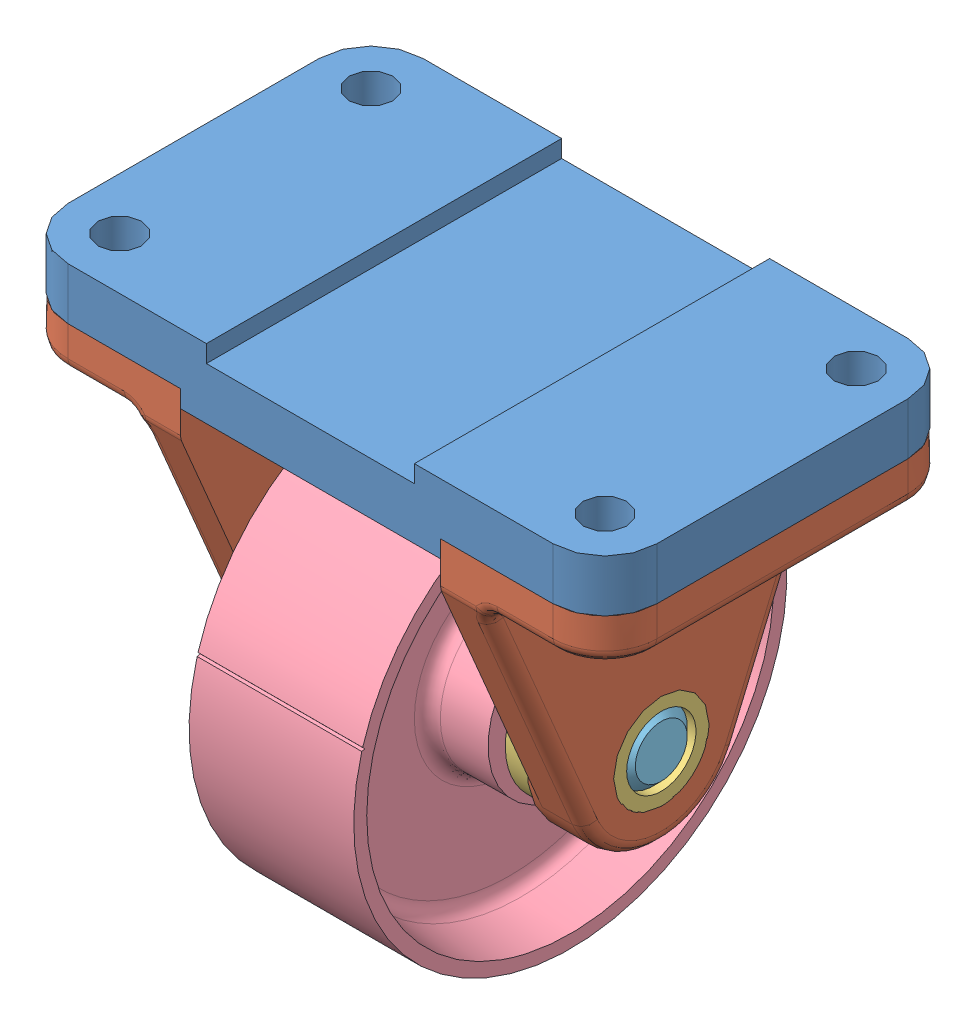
SolidWorks assembly 組合件5.sldasm, configuration 預設 (file format 11000). Lengths in mm.
Overall size (136 131.91 123.83).
7 component instances, 5 part files, 9 mates.
Components (placement in the parent):
- 01plate-1: 01plate.SLDPRT [預設] at (-43.4699 4.954 0) size (136 16 82)
- 02axle_sup-6: 02axle_sup.SLDPRT [預設] at (-3.4699 -49.046 0) size (40 77 82)
- 05bushing-2: 05bushing.SLDPRT [預設] at (-22.4699 -49.046 0) x (1 0 0) z (0 -0.781647 0.623721) size (19 34 34)
- 02axle_sup-9: 02axle_sup.SLDPRT [預設] at (-83.4699 -49.046 0) x (-1 0 0) z (0 0 -1) size (40 77 82)
- 05bushing-4: 05bushing.SLDPRT [預設] at (-64.4699 -49.046 0) x (-1 0 0) z (0 0.781647 -0.623721) size (19 34 34)
- 03wheel-3: 03wheel.SLDPRT [預設] at (-43.4699 -49.046 0) x (1 0 0) z (0 -0.96071 0.277556) size (38 100 100)
- 04axle-5: 04axle.SLDPRT [預設] at (-43.4699 -49.046 0) x (1 0 0) z (0 -0.149864 0.988707) size (80 22 22)
Mates (geometry in assembly coordinates):
- 同軸心1: concentric: cylinder of assembly; cylinder of assembly; cylinder of 01plate-1 through (12.5301 4.954 29) axis (0 1 0) radius 5; cylinder of 02axle_sup-6 through (12.5301 -1.046 29) axis (0 -1 0) radius 5.5
- 同軸心2: concentric: cylinder of assembly; cylinder of assembly; cylinder of 01plate-1 through (12.5301 4.954 -29) axis (0 1 0) radius 5; cylinder of 02axle_sup-6 through (12.5301 -1.046 -29) axis (0 -1 0) radius 5.5
- 重合/共線/共點1: coincident: plane of assembly; plane of assembly; plane of 01plate-1 through (-13.4699 8.954 41) normal (0 -1 0); plane of 02axle_sup-6 through (24.5301 8.954 -41) normal (0 1 0)
- 同軸心3: concentric: cylinder of assembly; cylinder of assembly; cylinder of 02axle_sup-6 through (-15.4699 -49.046 0) axis (1 0 0) radius 11; cylinder of 05bushing-2 through (-22.4699 -49.046 0) axis (-1 0 0) radius 11
- 重合/共線/共點2: coincident: plane of assembly; plane of assembly; plane of 02axle_sup-6 through (-15.4699 -49.046 0) normal (-1 0 0); plane of 05bushing-2 through (-15.4699 -38.4427 13.288) normal (1 0 0)
- 同軸心6: concentric: cylinder of assembly; cylinder of assembly; cylinder of 05bushing-2 through (-22.4699 -49.046 0) axis (-1 0 0) radius 8; cylinder of 03wheel-3 through (-74.1357 -49.046 0) axis (-1 0 0) radius 11
- 寬度1: width: plane of assembly; plane of assembly; plane of assembly; plane of assembly; plane of 05bushing-2 through (-22.4699 -44.0562 6.2532) normal (-1 0 0); plane of 05bushing-4 through (-64.4699 -44.0562 6.2532) normal (1 0 0); plane of 03wheel-3 through (-48.4699 -43.7724 18.2535) normal (-1 0 0); plane of 03wheel-3 through (-38.4699 -43.7724 18.2535) normal (1 0 0)
- 寬度4: width: plane of assembly; plane of assembly; plane of assembly; plane of assembly; plane of 04axle-5 through (-22.4699 -38.1702 1.6485) normal (1 0 0); plane of 04axle-5 through (-64.4699 -38.1702 1.6485) normal (-1 0 0); plane of 02axle_sup-6 through (-3.4699 -49.046 0) normal (1 0 0); plane of 02axle_sup-9 through (-83.4699 -49.046 0) normal (-1 0 0)
- 同軸心7: concentric: cylinder of assembly; cylinder of assembly; cylinder of 05bushing-2 through (-22.4699 -49.046 0) axis (-1 0 0) radius 8; cylinder of 04axle-5 through (-43.4699 -49.046 0) axis (-1 0 0) radius 8
